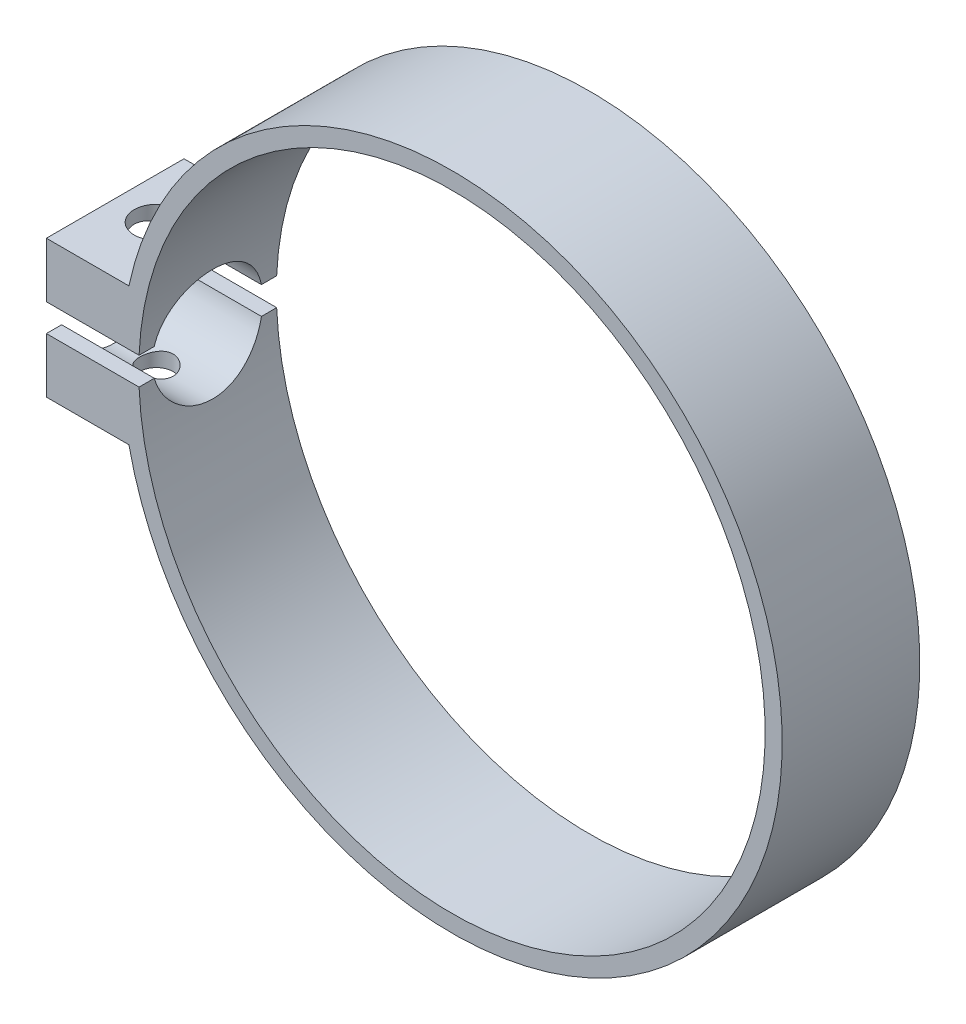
ISO-10303-21;
HEADER;
FILE_DESCRIPTION(('STEP AP214'),'2;1');
FILE_NAME('part.step','',(''),(''),'','','');
FILE_SCHEMA(('AUTOMOTIVE_DESIGN { 1 0 10303 214 1 1 1 1 }'));
ENDSEC;
DATA;
#1=APPLICATION_CONTEXT('core data for automotive mechanical design processes');
#2=APPLICATION_PROTOCOL_DEFINITION('international standard','automotive_design',2000,#1);
#3=PRODUCT_CONTEXT('',#1,'mechanical');
#4=PRODUCT('Part','Part','',(#3));
#5=PRODUCT_RELATED_PRODUCT_CATEGORY('part','',(#4));
#6=PRODUCT_DEFINITION_FORMATION('','',#4);
#7=PRODUCT_DEFINITION_CONTEXT('part definition',#1,'design');
#8=PRODUCT_DEFINITION('design','',#6,#7);
#9=PRODUCT_DEFINITION_SHAPE('','',#8);
#10=(LENGTH_UNIT() NAMED_UNIT(*) SI_UNIT(.MILLI.,.METRE.));
#11=(NAMED_UNIT(*) PLANE_ANGLE_UNIT() SI_UNIT($,.RADIAN.));
#12=(NAMED_UNIT(*) SI_UNIT($,.STERADIAN.) SOLID_ANGLE_UNIT());
#13=UNCERTAINTY_MEASURE_WITH_UNIT(LENGTH_MEASURE(1.E-05),#10,'distance_accuracy_value','');
#14=(GEOMETRIC_REPRESENTATION_CONTEXT(3) GLOBAL_UNCERTAINTY_ASSIGNED_CONTEXT((#13)) GLOBAL_UNIT_ASSIGNED_CONTEXT((#10,
#11,#12)) REPRESENTATION_CONTEXT('',''));
#15=CARTESIAN_POINT('',(0.,0.,0.));
#16=DIRECTION('',(0.,0.,1.));
#17=DIRECTION('',(1.,0.,0.));
#18=AXIS2_PLACEMENT_3D('',#15,#16,#17);
#19=CARTESIAN_POINT('',(-46.78900533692,-1.5875,15.875));
#20=DIRECTION('',(0.,-1.,0.));
#21=DIRECTION('',(1.,0.,0.));
#22=AXIS2_PLACEMENT_3D('',#19,#20,#21);
#23=PLANE('',#22);
#24=DIRECTION('',(0.,0.,-1.));
#25=VECTOR('',#24,1.);
#26=CARTESIAN_POINT('',(-36.0966083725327,-1.5875,15.875));
#27=LINE('',#26,#25);
#28=CARTESIAN_POINT('',(-36.0966083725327,-1.5875,15.875));
#29=VERTEX_POINT('',#28);
#30=CARTESIAN_POINT('',(-36.0966083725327,-1.5875,14.1172604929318));
#31=VERTEX_POINT('',#30);
#32=EDGE_CURVE('E145',#29,#31,#27,.T.);
#33=ORIENTED_EDGE('',*,*,#32,.T.);
#34=DIRECTION('',(-1.,0.,0.));
#35=VECTOR('',#34,1.);
#36=CARTESIAN_POINT('',(38.101,-1.58750000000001,14.1172604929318));
#37=LINE('',#36,#35);
#38=CARTESIAN_POINT('',(-46.78900533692,-1.5875,14.1172604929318));
#39=VERTEX_POINT('',#38);
#40=EDGE_CURVE('E129',#39,#31,#37,.F.);
#41=ORIENTED_EDGE('',*,*,#40,.F.);
#42=DIRECTION('',(0.,0.,-1.));
#43=VECTOR('',#42,1.);
#44=CARTESIAN_POINT('',(-46.78900533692,-1.5875,15.875));
#45=LINE('',#44,#43);
#46=CARTESIAN_POINT('',(-46.78900533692,-1.5875,15.875));
#47=VERTEX_POINT('',#46);
#48=EDGE_CURVE('E155',#47,#39,#45,.T.);
#49=ORIENTED_EDGE('',*,*,#48,.F.);
#50=DIRECTION('',(-1.,0.,0.));
#51=VECTOR('',#50,1.);
#52=CARTESIAN_POINT('',(-46.78900533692,-1.5875,15.875));
#53=LINE('',#52,#51);
#54=EDGE_CURVE('E150',#29,#47,#53,.T.);
#55=ORIENTED_EDGE('',*,*,#54,.F.);
#56=EDGE_LOOP('',(#33,#41,#49,#55));
#57=FACE_BOUND('',#56,.T.);
#58=ADVANCED_FACE('F36',(#57),#23,.F.);
#59=CARTESIAN_POINT('',(-46.78900533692,1.5875,15.875));
#60=DIRECTION('',(0.,1.,0.));
#61=DIRECTION('',(-1.,0.,0.));
#62=AXIS2_PLACEMENT_3D('',#59,#60,#61);
#63=PLANE('',#62);
#64=DIRECTION('',(0.,0.,-1.));
#65=VECTOR('',#64,1.);
#66=CARTESIAN_POINT('',(-36.0966083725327,1.5875,15.875));
#67=LINE('',#66,#65);
#68=CARTESIAN_POINT('',(-36.0966083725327,1.5875,1.75773950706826));
#69=VERTEX_POINT('',#68);
#70=CARTESIAN_POINT('',(-36.0966083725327,1.5875,0.));
#71=VERTEX_POINT('',#70);
#72=EDGE_CURVE('E151',#69,#71,#67,.T.);
#73=ORIENTED_EDGE('',*,*,#72,.F.);
#74=DIRECTION('',(-1.,0.,0.));
#75=VECTOR('',#74,1.);
#76=CARTESIAN_POINT('',(38.101,1.58750000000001,1.75773950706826));
#77=LINE('',#76,#75);
#78=CARTESIAN_POINT('',(-46.78900533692,1.5875,1.75773950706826));
#79=VERTEX_POINT('',#78);
#80=EDGE_CURVE('E65',#79,#69,#77,.F.);
#81=ORIENTED_EDGE('',*,*,#80,.F.);
#82=DIRECTION('',(0.,0.,-1.));
#83=VECTOR('',#82,1.);
#84=CARTESIAN_POINT('',(-46.78900533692,1.5875,15.875));
#85=LINE('',#84,#83);
#86=CARTESIAN_POINT('',(-46.78900533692,1.5875,0.));
#87=VERTEX_POINT('',#86);
#88=EDGE_CURVE('E160',#79,#87,#85,.T.);
#89=ORIENTED_EDGE('',*,*,#88,.T.);
#90=DIRECTION('',(1.,0.,0.));
#91=VECTOR('',#90,1.);
#92=CARTESIAN_POINT('',(-46.78900533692,1.5875,0.));
#93=LINE('',#92,#91);
#94=EDGE_CURVE('E183',#87,#71,#93,.T.);
#95=ORIENTED_EDGE('',*,*,#94,.T.);
#96=EDGE_LOOP('',(#73,#81,#89,#95));
#97=FACE_BOUND('',#96,.T.);
#98=ADVANCED_FACE('F275',(#97),#63,.F.);
#99=CARTESIAN_POINT('',(0.,0.,15.875));
#100=DIRECTION('',(0.,0.,-1.));
#101=DIRECTION('',(-1.,0.,0.));
#102=AXIS2_PLACEMENT_3D('',#99,#100,#101);
#103=CYLINDRICAL_SURFACE('',#102,38.1);
#104=CARTESIAN_POINT('',(0.,0.,0.));
#105=DIRECTION('',(0.,0.,1.));
#106=DIRECTION('',(1.,0.,0.));
#107=AXIS2_PLACEMENT_3D('',#104,#105,#106);
#108=CIRCLE('',#107,38.1);
#109=CARTESIAN_POINT('',(-37.26400533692,-7.9375,0.));
#110=VERTEX_POINT('',#109);
#111=CARTESIAN_POINT('',(-37.26400533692,7.9375,0.));
#112=VERTEX_POINT('',#111);
#113=EDGE_CURVE('E187',#110,#112,#108,.T.);
#114=ORIENTED_EDGE('',*,*,#113,.T.);
#115=DIRECTION('',(0.,0.,-1.));
#116=VECTOR('',#115,1.);
#117=CARTESIAN_POINT('',(-37.26400533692,7.9375,15.875));
#118=LINE('',#117,#116);
#119=CARTESIAN_POINT('',(-37.26400533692,7.9375,15.875));
#120=VERTEX_POINT('',#119);
#121=EDGE_CURVE('E11',#120,#112,#118,.T.);
#122=ORIENTED_EDGE('',*,*,#121,.F.);
#123=CARTESIAN_POINT('',(0.,0.,15.875));
#124=DIRECTION('',(0.,0.,1.));
#125=DIRECTION('',(1.,0.,0.));
#126=AXIS2_PLACEMENT_3D('',#123,#124,#125);
#127=CIRCLE('',#126,38.1);
#128=CARTESIAN_POINT('',(-37.26400533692,-7.9375,15.875));
#129=VERTEX_POINT('',#128);
#130=EDGE_CURVE('E199',#129,#120,#127,.T.);
#131=ORIENTED_EDGE('',*,*,#130,.F.);
#132=DIRECTION('',(0.,0.,-1.));
#133=VECTOR('',#132,1.);
#134=CARTESIAN_POINT('',(-37.26400533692,-7.9375,15.875));
#135=LINE('',#134,#133);
#136=EDGE_CURVE('E200',#129,#110,#135,.T.);
#137=ORIENTED_EDGE('',*,*,#136,.T.);
#138=EDGE_LOOP('',(#114,#122,#131,#137));
#139=FACE_BOUND('',#138,.T.);
#140=ADVANCED_FACE('F38',(#139),#103,.T.);
#141=CARTESIAN_POINT('',(-37.26400533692,7.9375,15.875));
#142=DIRECTION('',(0.,-1.,0.));
#143=DIRECTION('',(1.,0.,0.));
#144=AXIS2_PLACEMENT_3D('',#141,#142,#143);
#145=PLANE('',#144);
#146=CARTESIAN_POINT('',(-42.02650533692,7.93750000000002,7.9375));
#147=DIRECTION('',(0.,1.,0.));
#148=DIRECTION('',(-1.,0.,0.));
#149=AXIS2_PLACEMENT_3D('',#146,#147,#148);
#150=CIRCLE('',#149,2.5527);
#151=CARTESIAN_POINT('',(-44.57920533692,7.93750000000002,7.9375));
#152=VERTEX_POINT('',#151);
#153=EDGE_CURVE('E259',#152,#152,#150,.T.);
#154=ORIENTED_EDGE('',*,*,#153,.F.);
#155=EDGE_LOOP('',(#154));
#156=FACE_BOUND('',#155,.T.);
#157=DIRECTION('',(-1.,0.,0.));
#158=VECTOR('',#157,1.);
#159=CARTESIAN_POINT('',(-37.26400533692,7.9375,0.));
#160=LINE('',#159,#158);
#161=CARTESIAN_POINT('',(-46.78900533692,7.9375,0.));
#162=VERTEX_POINT('',#161);
#163=EDGE_CURVE('E180',#112,#162,#160,.T.);
#164=ORIENTED_EDGE('',*,*,#163,.T.);
#165=DIRECTION('',(0.,0.,-1.));
#166=VECTOR('',#165,1.);
#167=CARTESIAN_POINT('',(-46.78900533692,7.9375,15.875));
#168=LINE('',#167,#166);
#169=CARTESIAN_POINT('',(-46.78900533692,7.9375,15.875));
#170=VERTEX_POINT('',#169);
#171=EDGE_CURVE('E50',#170,#162,#168,.T.);
#172=ORIENTED_EDGE('',*,*,#171,.F.);
#173=DIRECTION('',(-1.,0.,0.));
#174=VECTOR('',#173,1.);
#175=CARTESIAN_POINT('',(-37.26400533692,7.9375,15.875));
#176=LINE('',#175,#174);
#177=EDGE_CURVE('E298',#120,#170,#176,.T.);
#178=ORIENTED_EDGE('',*,*,#177,.F.);
#179=ORIENTED_EDGE('',*,*,#121,.T.);
#180=EDGE_LOOP('',(#164,#172,#178,#179));
#181=FACE_BOUND('',#180,.T.);
#182=ADVANCED_FACE('F335',(#156,#181),#145,.F.);
#183=CARTESIAN_POINT('',(-46.78900533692,7.9375,15.875));
#184=DIRECTION('',(1.,0.,0.));
#185=DIRECTION('',(0.,0.,-1.));
#186=AXIS2_PLACEMENT_3D('',#183,#184,#185);
#187=PLANE('',#186);
#188=ORIENTED_EDGE('',*,*,#88,.F.);
#189=CARTESIAN_POINT('',(-46.78900533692,0.127000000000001,7.93750000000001));
#190=DIRECTION('',(-1.,0.,0.));
#191=DIRECTION('',(0.,0.,1.));
#192=AXIS2_PLACEMENT_3D('',#189,#190,#191);
#193=CIRCLE('',#192,6.35);
#194=CARTESIAN_POINT('',(-46.78900533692,1.5875,14.1172604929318));
#195=VERTEX_POINT('',#194);
#196=EDGE_CURVE('E222',#195,#79,#193,.T.);
#197=ORIENTED_EDGE('',*,*,#196,.F.);
#198=CARTESIAN_POINT('',(-46.78900533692,1.5875,15.875));
#199=VERTEX_POINT('',#198);
#200=EDGE_CURVE('E161',#199,#195,#85,.T.);
#201=ORIENTED_EDGE('',*,*,#200,.F.);
#202=DIRECTION('',(0.,-1.,0.));
#203=VECTOR('',#202,1.);
#204=CARTESIAN_POINT('',(-46.78900533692,7.9375,15.875));
#205=LINE('',#204,#203);
#206=EDGE_CURVE('E175',#170,#199,#205,.T.);
#207=ORIENTED_EDGE('',*,*,#206,.F.);
#208=ORIENTED_EDGE('',*,*,#171,.T.);
#209=DIRECTION('',(0.,-1.,0.));
#210=VECTOR('',#209,1.);
#211=CARTESIAN_POINT('',(-46.78900533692,7.9375,0.));
#212=LINE('',#211,#210);
#213=EDGE_CURVE('E172',#162,#87,#212,.T.);
#214=ORIENTED_EDGE('',*,*,#213,.T.);
#215=EDGE_LOOP('',(#188,#197,#201,#207,#208,#214));
#216=FACE_BOUND('',#215,.T.);
#217=ADVANCED_FACE('F171',(#216),#187,.F.);
#218=ORIENTED_EDGE('',*,*,#200,.T.);
#219=DIRECTION('',(-1.,0.,0.));
#220=VECTOR('',#219,1.);
#221=CARTESIAN_POINT('',(38.101,1.58750000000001,14.1172604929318));
#222=LINE('',#221,#220);
#223=CARTESIAN_POINT('',(-36.0966083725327,1.5875,14.1172604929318));
#224=VERTEX_POINT('',#223);
#225=EDGE_CURVE('E228',#224,#195,#222,.T.);
#226=ORIENTED_EDGE('',*,*,#225,.F.);
#227=CARTESIAN_POINT('',(-36.0966083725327,1.5875,15.875));
#228=VERTEX_POINT('',#227);
#229=EDGE_CURVE('E153',#228,#224,#67,.T.);
#230=ORIENTED_EDGE('',*,*,#229,.F.);
#231=DIRECTION('',(1.,0.,0.));
#232=VECTOR('',#231,1.);
#233=CARTESIAN_POINT('',(-46.78900533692,1.5875,15.875));
#234=LINE('',#233,#232);
#235=EDGE_CURVE('E303',#199,#228,#234,.T.);
#236=ORIENTED_EDGE('',*,*,#235,.F.);
#237=EDGE_LOOP('',(#218,#226,#230,#236));
#238=FACE_BOUND('',#237,.T.);
#239=ADVANCED_FACE('F283',(#238),#63,.F.);
#240=CARTESIAN_POINT('',(0.,0.,15.875));
#241=DIRECTION('',(0.,0.,-1.));
#242=DIRECTION('',(-1.,0.,0.));
#243=AXIS2_PLACEMENT_3D('',#240,#241,#242);
#244=CYLINDRICAL_SURFACE('',#243,36.1315);
#245=CARTESIAN_POINT('',(-36.0966083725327,-1.58750000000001,1.75773950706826));
#246=VERTEX_POINT('',#245);
#247=CARTESIAN_POINT('',(-36.0966083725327,-1.5875,0.));
#248=VERTEX_POINT('',#247);
#249=EDGE_CURVE('E148',#246,#248,#27,.T.);
#250=ORIENTED_EDGE('',*,*,#249,.F.);
#251=CARTESIAN_POINT('',(-36.0966083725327,-1.5875,14.1172604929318));
#252=CARTESIAN_POINT('',(-36.0889745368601,-1.76132982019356,14.0761983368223));
#253=CARTESIAN_POINT('',(-36.0801399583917,-1.93335947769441,14.0277786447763));
#254=CARTESIAN_POINT('',(-36.060355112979,-2.27260532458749,13.9166858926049));
#255=CARTESIAN_POINT('',(-36.0494051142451,-2.43982212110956,13.8540146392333));
#256=CARTESIAN_POINT('',(-36.0256858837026,-2.76809747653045,13.7149445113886));
#257=CARTESIAN_POINT('',(-36.0129186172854,-2.92916245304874,13.6385604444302));
#258=CARTESIAN_POINT('',(-35.9859053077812,-3.24420959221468,13.4725881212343));
#259=CARTESIAN_POINT('',(-35.9716592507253,-3.39819168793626,13.3829997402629));
#260=CARTESIAN_POINT('',(-35.9420752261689,-3.69800183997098,13.1912706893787));
#261=CARTESIAN_POINT('',(-35.9267373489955,-3.84383056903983,13.0891310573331));
#262=CARTESIAN_POINT('',(-35.895379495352,-4.1264078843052,12.872972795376));
#263=CARTESIAN_POINT('',(-35.8793592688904,-4.26315309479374,12.7589497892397));
#264=CARTESIAN_POINT('',(-35.8470845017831,-4.52652454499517,12.5198902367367));
#265=CARTESIAN_POINT('',(-35.8308300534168,-4.65315464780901,12.3948579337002));
#266=CARTESIAN_POINT('',(-35.7985193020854,-4.89553531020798,12.1345477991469));
#267=CARTESIAN_POINT('',(-35.7824630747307,-5.01128182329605,11.99926619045));
#268=CARTESIAN_POINT('',(-35.7508879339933,-5.23180673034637,11.71844452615));
#269=CARTESIAN_POINT('',(-35.73537352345,-5.33650342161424,11.5728397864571));
#270=CARTESIAN_POINT('',(-35.7054321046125,-5.533292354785,11.2731630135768));
#271=CARTESIAN_POINT('',(-35.6910055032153,-5.62537989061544,11.1190878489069));
#272=CARTESIAN_POINT('',(-35.6636614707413,-5.79620800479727,10.8036373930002));
#273=CARTESIAN_POINT('',(-35.6507435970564,-5.87495250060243,10.6422642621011));
#274=CARTESIAN_POINT('',(-35.6267802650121,-6.01856510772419,10.313250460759));
#275=CARTESIAN_POINT('',(-35.6157354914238,-6.08342814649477,10.1456075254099));
#276=CARTESIAN_POINT('',(-35.5959127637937,-6.19836007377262,9.80643943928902));
#277=CARTESIAN_POINT('',(-35.5871202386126,-6.24852437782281,9.63494747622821));
#278=CARTESIAN_POINT('',(-35.5719600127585,-6.33426016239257,9.28817846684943));
#279=CARTESIAN_POINT('',(-35.5655932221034,-6.36982616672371,9.11290002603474));
#280=CARTESIAN_POINT('',(-35.5554793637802,-6.4260404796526,8.75999412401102));
#281=CARTESIAN_POINT('',(-35.5517308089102,-6.44669725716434,8.5823680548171));
#282=CARTESIAN_POINT('',(-35.5469573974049,-6.47296621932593,8.22588898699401));
#283=CARTESIAN_POINT('',(-35.5459337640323,-6.47857164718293,8.04703547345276));
#284=CARTESIAN_POINT('',(-35.5466389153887,-6.47470125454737,7.69204467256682));
#285=CARTESIAN_POINT('',(-35.5483287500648,-6.46543885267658,7.51590494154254));
#286=CARTESIAN_POINT('',(-35.5543377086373,-6.43231255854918,7.16513096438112));
#287=CARTESIAN_POINT('',(-35.5586556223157,-6.4084553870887,6.99049606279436));
#288=CARTESIAN_POINT('',(-35.5697984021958,-6.3463161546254,6.64380965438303));
#289=CARTESIAN_POINT('',(-35.5766244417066,-6.30802734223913,6.47175939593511));
#290=CARTESIAN_POINT('',(-35.5925855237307,-6.21733580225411,6.13159780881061));
#291=CARTESIAN_POINT('',(-35.6017197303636,-6.16493818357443,5.96348507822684));
#292=CARTESIAN_POINT('',(-35.6220430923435,-6.04639992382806,5.63225501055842));
#293=CARTESIAN_POINT('',(-35.6332328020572,-5.98025557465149,5.46913903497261));
#294=CARTESIAN_POINT('',(-35.6573484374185,-5.83474317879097,5.14912168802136));
#295=CARTESIAN_POINT('',(-35.6702737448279,-5.75537983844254,4.99221812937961));
#296=CARTESIAN_POINT('',(-35.6975113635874,-5.58395072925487,4.68556909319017));
#297=CARTESIAN_POINT('',(-35.7118241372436,-5.49188072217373,4.53582602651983));
#298=CARTESIAN_POINT('',(-35.7414369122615,-5.29573506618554,4.24460292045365));
#299=CARTESIAN_POINT('',(-35.7567365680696,-5.19166360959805,4.10312002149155));
#300=CARTESIAN_POINT('',(-35.7881417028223,-4.97059818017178,3.82729976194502));
#301=CARTESIAN_POINT('',(-35.8042556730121,-4.85343806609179,3.69309649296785));
#302=CARTESIAN_POINT('',(-35.8366292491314,-4.60831529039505,3.43505961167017));
#303=CARTESIAN_POINT('',(-35.852888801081,-4.48035649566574,3.31122231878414));
#304=CARTESIAN_POINT('',(-35.8851209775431,-4.21441906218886,3.07466244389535));
#305=CARTESIAN_POINT('',(-35.9010934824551,-4.07643636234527,2.96194441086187));
#306=CARTESIAN_POINT('',(-35.9323034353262,-3.79148942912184,2.74850276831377));
#307=CARTESIAN_POINT('',(-35.9475411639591,-3.64452867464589,2.64777455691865));
#308=CARTESIAN_POINT('',(-35.9764251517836,-3.34719931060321,2.46186194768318));
#309=CARTESIAN_POINT('',(-35.9901058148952,-3.19707208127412,2.37629661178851));
#310=CARTESIAN_POINT('',(-36.0160444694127,-2.89025000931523,2.21764167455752));
#311=CARTESIAN_POINT('',(-36.0283025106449,-2.73355539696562,2.14455163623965));
#312=CARTESIAN_POINT('',(-36.0510891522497,-2.41449922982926,2.01130892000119));
#313=CARTESIAN_POINT('',(-36.0616164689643,-2.25213357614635,1.95116583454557));
#314=CARTESIAN_POINT('',(-36.0806747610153,-1.92290955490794,1.84428861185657));
#315=CARTESIAN_POINT('',(-36.0892054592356,-1.75605056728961,1.79755633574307));
#316=CARTESIAN_POINT('',(-36.0966083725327,-1.5875,1.75773950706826));
#317=B_SPLINE_CURVE_WITH_KNOTS('',3,(#251,#252,#253,#254,#255,#256,#257,#258,#259,#260,#261,
#262,#263,#264,#265,#266,#267,#268,#269,#270,#271,#272,#273,#274,#275,#276,#277,#278,#279,#280,
#281,#282,#283,#284,#285,#286,#287,#288,#289,#290,#291,#292,#293,#294,#295,#296,#297,#298,#299,
#300,#301,#302,#303,#304,#305,#306,#307,#308,#309,#310,#311,#312,#313,#314,#315,#316),
.UNSPECIFIED.,.F.,.F.,(4,2,2,2,2,2,2,2,2,2,2,2,2,2,2,2,2,2,2,2,2,2,2,2,2,2,2,2,2,2,2,2,4),(0.,
0.536155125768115,1.07224231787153,1.6077540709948,2.14327088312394,2.6787434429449,
3.21441389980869,3.74987878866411,4.28554198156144,4.82492306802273,5.36450492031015,
5.90392807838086,6.44354801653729,6.97958324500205,7.51581937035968,8.05175065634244,
8.58792249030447,9.11646648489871,9.64476727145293,10.1733155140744,10.7016726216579,
11.2301724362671,11.7584844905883,12.2869731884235,12.8152778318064,13.3512773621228,
13.88708576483,14.4231124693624,14.958932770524,15.4783789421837,15.9978069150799,
16.5176184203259,17.0375020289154),.UNSPECIFIED.);
#318=EDGE_CURVE('E132',#31,#246,#317,.T.);
#319=ORIENTED_EDGE('',*,*,#318,.F.);
#320=ORIENTED_EDGE('',*,*,#32,.F.);
#321=CARTESIAN_POINT('',(0.,0.,15.875));
#322=DIRECTION('',(0.,0.,-1.));
#323=DIRECTION('',(1.,0.,0.));
#324=AXIS2_PLACEMENT_3D('',#321,#322,#323);
#325=CIRCLE('',#324,36.1315);
#326=EDGE_CURVE('E218',#228,#29,#325,.T.);
#327=ORIENTED_EDGE('',*,*,#326,.F.);
#328=ORIENTED_EDGE('',*,*,#229,.T.);
#329=CARTESIAN_POINT('',(-36.0966083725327,1.5875,1.75773950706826));
#330=CARTESIAN_POINT('',(-36.0889745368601,1.76132982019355,1.79880166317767));
#331=CARTESIAN_POINT('',(-36.0801399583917,1.9333594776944,1.84722135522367));
#332=CARTESIAN_POINT('',(-36.060355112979,2.27260532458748,1.95831410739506));
#333=CARTESIAN_POINT('',(-36.0494051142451,2.43982212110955,2.02098536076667));
#334=CARTESIAN_POINT('',(-36.0256858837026,2.76809747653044,2.16005548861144));
#335=CARTESIAN_POINT('',(-36.0129186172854,2.92916245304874,2.2364395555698));
#336=CARTESIAN_POINT('',(-35.9859053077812,3.24420959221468,2.40241187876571));
#337=CARTESIAN_POINT('',(-35.9716592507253,3.39819168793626,2.49200025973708));
#338=CARTESIAN_POINT('',(-35.9420752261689,3.69800183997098,2.6837293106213));
#339=CARTESIAN_POINT('',(-35.9267373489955,3.84383056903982,2.7858689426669));
#340=CARTESIAN_POINT('',(-35.895379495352,4.1264078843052,3.002027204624));
#341=CARTESIAN_POINT('',(-35.8793592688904,4.26315309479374,3.11605021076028));
#342=CARTESIAN_POINT('',(-35.8470845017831,4.52652454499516,3.3551097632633));
#343=CARTESIAN_POINT('',(-35.8308300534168,4.653154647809,3.48014206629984));
#344=CARTESIAN_POINT('',(-35.7985193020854,4.89553531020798,3.7404522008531));
#345=CARTESIAN_POINT('',(-35.7824630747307,5.01128182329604,3.87573380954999));
#346=CARTESIAN_POINT('',(-35.7508879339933,5.23180673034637,4.15655547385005));
#347=CARTESIAN_POINT('',(-35.73537352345,5.33650342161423,4.30216021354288));
#348=CARTESIAN_POINT('',(-35.7054321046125,5.533292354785,4.60183698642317));
#349=CARTESIAN_POINT('',(-35.6910055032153,5.62537989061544,4.75591215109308));
#350=CARTESIAN_POINT('',(-35.6636614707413,5.79620800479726,5.07136260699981));
#351=CARTESIAN_POINT('',(-35.6507435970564,5.87495250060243,5.23273573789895));
#352=CARTESIAN_POINT('',(-35.6267802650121,6.01856510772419,5.56174953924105));
#353=CARTESIAN_POINT('',(-35.6157354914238,6.08342814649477,5.72939247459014));
#354=CARTESIAN_POINT('',(-35.5959127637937,6.19836007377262,6.06856056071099));
#355=CARTESIAN_POINT('',(-35.5871202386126,6.24852437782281,6.2400525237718));
#356=CARTESIAN_POINT('',(-35.5719600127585,6.33426016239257,6.58682153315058));
#357=CARTESIAN_POINT('',(-35.5655932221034,6.36982616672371,6.76209997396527));
#358=CARTESIAN_POINT('',(-35.5554793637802,6.4260404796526,7.11500587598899));
#359=CARTESIAN_POINT('',(-35.5517308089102,6.44669725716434,7.29263194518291));
#360=CARTESIAN_POINT('',(-35.5469573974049,6.47296621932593,7.649111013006));
#361=CARTESIAN_POINT('',(-35.5459337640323,6.47857164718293,7.82796452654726));
#362=CARTESIAN_POINT('',(-35.5466389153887,6.47470125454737,8.18295532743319));
#363=CARTESIAN_POINT('',(-35.5483287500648,6.46543885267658,8.35909505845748));
#364=CARTESIAN_POINT('',(-35.5543377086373,6.43231255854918,8.70986903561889));
#365=CARTESIAN_POINT('',(-35.5586556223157,6.4084553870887,8.88450393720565));
#366=CARTESIAN_POINT('',(-35.5697984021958,6.3463161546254,9.23119034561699));
#367=CARTESIAN_POINT('',(-35.5766244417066,6.30802734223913,9.40324060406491));
#368=CARTESIAN_POINT('',(-35.5925855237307,6.21733580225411,9.7434021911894));
#369=CARTESIAN_POINT('',(-35.6017197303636,6.16493818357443,9.91151492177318));
#370=CARTESIAN_POINT('',(-35.6220430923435,6.04639992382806,10.2427449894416));
#371=CARTESIAN_POINT('',(-35.6332328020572,5.9802555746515,10.4058609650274));
#372=CARTESIAN_POINT('',(-35.6573484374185,5.83474317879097,10.7258783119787));
#373=CARTESIAN_POINT('',(-35.6702737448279,5.75537983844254,10.8827818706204));
#374=CARTESIAN_POINT('',(-35.6975113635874,5.58395072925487,11.1894309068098));
#375=CARTESIAN_POINT('',(-35.7118241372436,5.49188072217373,11.3391739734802));
#376=CARTESIAN_POINT('',(-35.7414369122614,5.29573506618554,11.6303970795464));
#377=CARTESIAN_POINT('',(-35.7567365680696,5.19166360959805,11.7718799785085));
#378=CARTESIAN_POINT('',(-35.7881417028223,4.97059818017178,12.047700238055));
#379=CARTESIAN_POINT('',(-35.8042556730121,4.85343806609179,12.1819035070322));
#380=CARTESIAN_POINT('',(-35.8366292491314,4.60831529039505,12.4399403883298));
#381=CARTESIAN_POINT('',(-35.852888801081,4.48035649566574,12.5637776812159));
#382=CARTESIAN_POINT('',(-35.8851209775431,4.21441906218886,12.8003375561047));
#383=CARTESIAN_POINT('',(-35.9010934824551,4.07643636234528,12.9130555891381));
#384=CARTESIAN_POINT('',(-35.9323034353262,3.79148942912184,13.1264972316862));
#385=CARTESIAN_POINT('',(-35.9475411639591,3.64452867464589,13.2272254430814));
#386=CARTESIAN_POINT('',(-35.9764251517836,3.34719931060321,13.4131380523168));
#387=CARTESIAN_POINT('',(-35.9901058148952,3.19707208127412,13.4987033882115));
#388=CARTESIAN_POINT('',(-36.0160444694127,2.89025000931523,13.6573583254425));
#389=CARTESIAN_POINT('',(-36.0283025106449,2.73355539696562,13.7304483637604));
#390=CARTESIAN_POINT('',(-36.0510891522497,2.41449922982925,13.8636910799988));
#391=CARTESIAN_POINT('',(-36.0616164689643,2.25213357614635,13.9238341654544));
#392=CARTESIAN_POINT('',(-36.0806747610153,1.92290955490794,14.0307113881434));
#393=CARTESIAN_POINT('',(-36.0892054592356,1.75605056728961,14.0774436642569));
#394=CARTESIAN_POINT('',(-36.0966083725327,1.5875,14.1172604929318));
#395=B_SPLINE_CURVE_WITH_KNOTS('',3,(#329,#330,#331,#332,#333,#334,#335,#336,#337,#338,#339,
#340,#341,#342,#343,#344,#345,#346,#347,#348,#349,#350,#351,#352,#353,#354,#355,#356,#357,#358,
#359,#360,#361,#362,#363,#364,#365,#366,#367,#368,#369,#370,#371,#372,#373,#374,#375,#376,#377,
#378,#379,#380,#381,#382,#383,#384,#385,#386,#387,#388,#389,#390,#391,#392,#393,#394),
.UNSPECIFIED.,.F.,.F.,(4,2,2,2,2,2,2,2,2,2,2,2,2,2,2,2,2,2,2,2,2,2,2,2,2,2,2,2,2,2,2,2,4),(0.,
0.536155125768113,1.07224231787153,1.60775407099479,2.14327088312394,2.6787434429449,
3.21441389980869,3.74987878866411,4.28554198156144,4.82492306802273,5.36450492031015,
5.90392807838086,6.44354801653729,6.97958324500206,7.51581937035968,8.05175065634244,
8.58792249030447,9.11646648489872,9.64476727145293,10.1733155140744,10.7016726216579,
11.2301724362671,11.7584844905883,12.2869731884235,12.8152778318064,13.3512773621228,
13.88708576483,14.4231124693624,14.9589327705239,15.4783789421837,15.9978069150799,
16.5176184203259,17.0375020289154),.UNSPECIFIED.);
#396=EDGE_CURVE('E225',#69,#224,#395,.T.);
#397=ORIENTED_EDGE('',*,*,#396,.F.);
#398=ORIENTED_EDGE('',*,*,#72,.T.);
#399=CARTESIAN_POINT('',(0.,0.,0.));
#400=DIRECTION('',(0.,0.,-1.));
#401=DIRECTION('',(1.,0.,0.));
#402=AXIS2_PLACEMENT_3D('',#399,#400,#401);
#403=CIRCLE('',#402,36.1315);
#404=EDGE_CURVE('E185',#71,#248,#403,.T.);
#405=ORIENTED_EDGE('',*,*,#404,.T.);
#406=EDGE_LOOP('',(#250,#319,#320,#327,#328,#397,#398,#405));
#407=FACE_BOUND('',#406,.T.);
#408=ADVANCED_FACE('F143',(#407),#244,.F.);
#409=CARTESIAN_POINT('',(-46.78900533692,-1.5875,1.75773950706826));
#410=VERTEX_POINT('',#409);
#411=CARTESIAN_POINT('',(-46.78900533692,-1.5875,0.));
#412=VERTEX_POINT('',#411);
#413=EDGE_CURVE('E205',#410,#412,#45,.T.);
#414=ORIENTED_EDGE('',*,*,#413,.F.);
#415=DIRECTION('',(-1.,0.,0.));
#416=VECTOR('',#415,1.);
#417=CARTESIAN_POINT('',(38.101,-1.58750000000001,1.75773950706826));
#418=LINE('',#417,#416);
#419=EDGE_CURVE('E57',#246,#410,#418,.T.);
#420=ORIENTED_EDGE('',*,*,#419,.F.);
#421=ORIENTED_EDGE('',*,*,#249,.T.);
#422=DIRECTION('',(-1.,0.,0.));
#423=VECTOR('',#422,1.);
#424=CARTESIAN_POINT('',(-46.78900533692,-1.5875,0.));
#425=LINE('',#424,#423);
#426=EDGE_CURVE('E192',#248,#412,#425,.T.);
#427=ORIENTED_EDGE('',*,*,#426,.T.);
#428=EDGE_LOOP('',(#414,#420,#421,#427));
#429=FACE_BOUND('',#428,.T.);
#430=ADVANCED_FACE('F277',(#429),#23,.F.);
#431=CARTESIAN_POINT('',(-46.78900533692,-7.9375,15.875));
#432=DIRECTION('',(1.,0.,0.));
#433=DIRECTION('',(0.,0.,-1.));
#434=AXIS2_PLACEMENT_3D('',#431,#432,#433);
#435=PLANE('',#434);
#436=ORIENTED_EDGE('',*,*,#48,.T.);
#437=CARTESIAN_POINT('',(-46.78900533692,-0.127000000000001,7.93750000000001));
#438=DIRECTION('',(-1.,0.,0.));
#439=DIRECTION('',(0.,0.,1.));
#440=AXIS2_PLACEMENT_3D('',#437,#438,#439);
#441=CIRCLE('',#440,6.35);
#442=EDGE_CURVE('E133',#410,#39,#441,.T.);
#443=ORIENTED_EDGE('',*,*,#442,.F.);
#444=ORIENTED_EDGE('',*,*,#413,.T.);
#445=DIRECTION('',(0.,-1.,0.));
#446=VECTOR('',#445,1.);
#447=CARTESIAN_POINT('',(-46.78900533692,-7.9375,0.));
#448=LINE('',#447,#446);
#449=CARTESIAN_POINT('',(-46.78900533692,-7.9375,0.));
#450=VERTEX_POINT('',#449);
#451=EDGE_CURVE('E195',#412,#450,#448,.T.);
#452=ORIENTED_EDGE('',*,*,#451,.T.);
#453=DIRECTION('',(0.,0.,-1.));
#454=VECTOR('',#453,1.);
#455=CARTESIAN_POINT('',(-46.78900533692,-7.9375,15.875));
#456=LINE('',#455,#454);
#457=CARTESIAN_POINT('',(-46.78900533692,-7.9375,15.875));
#458=VERTEX_POINT('',#457);
#459=EDGE_CURVE('E202',#458,#450,#456,.T.);
#460=ORIENTED_EDGE('',*,*,#459,.F.);
#461=DIRECTION('',(0.,-1.,0.));
#462=VECTOR('',#461,1.);
#463=CARTESIAN_POINT('',(-46.78900533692,-7.9375,15.875));
#464=LINE('',#463,#462);
#465=EDGE_CURVE('E214',#47,#458,#464,.T.);
#466=ORIENTED_EDGE('',*,*,#465,.F.);
#467=EDGE_LOOP('',(#436,#443,#444,#452,#460,#466));
#468=FACE_BOUND('',#467,.T.);
#469=ADVANCED_FACE('F213',(#468),#435,.F.);
#470=CARTESIAN_POINT('',(-37.26400533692,-7.9375,15.875));
#471=DIRECTION('',(0.,1.,0.));
#472=DIRECTION('',(-1.,0.,0.));
#473=AXIS2_PLACEMENT_3D('',#470,#471,#472);
#474=PLANE('',#473);
#475=CARTESIAN_POINT('',(-42.02650533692,-7.9375,7.9375));
#476=DIRECTION('',(0.,1.,0.));
#477=DIRECTION('',(-1.,0.,0.));
#478=AXIS2_PLACEMENT_3D('',#475,#476,#477);
#479=CIRCLE('',#478,1.92659);
#480=CARTESIAN_POINT('',(-43.95309533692,-7.9375,7.9375));
#481=VERTEX_POINT('',#480);
#482=EDGE_CURVE('E330',#481,#481,#479,.T.);
#483=ORIENTED_EDGE('',*,*,#482,.T.);
#484=EDGE_LOOP('',(#483));
#485=FACE_BOUND('',#484,.T.);
#486=DIRECTION('',(1.,0.,0.));
#487=VECTOR('',#486,1.);
#488=CARTESIAN_POINT('',(-37.26400533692,-7.9375,0.));
#489=LINE('',#488,#487);
#490=EDGE_CURVE('E197',#450,#110,#489,.T.);
#491=ORIENTED_EDGE('',*,*,#490,.T.);
#492=ORIENTED_EDGE('',*,*,#136,.F.);
#493=DIRECTION('',(1.,0.,0.));
#494=VECTOR('',#493,1.);
#495=CARTESIAN_POINT('',(-37.26400533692,-7.9375,15.875));
#496=LINE('',#495,#494);
#497=EDGE_CURVE('E203',#458,#129,#496,.T.);
#498=ORIENTED_EDGE('',*,*,#497,.F.);
#499=ORIENTED_EDGE('',*,*,#459,.T.);
#500=EDGE_LOOP('',(#491,#492,#498,#499));
#501=FACE_BOUND('',#500,.T.);
#502=ADVANCED_FACE('F292',(#485,#501),#474,.F.);
#503=CARTESIAN_POINT('',(0.,0.,15.875));
#504=DIRECTION('',(0.,0.,1.));
#505=DIRECTION('',(1.,0.,0.));
#506=AXIS2_PLACEMENT_3D('',#503,#504,#505);
#507=PLANE('',#506);
#508=ORIENTED_EDGE('',*,*,#130,.T.);
#509=ORIENTED_EDGE('',*,*,#177,.T.);
#510=ORIENTED_EDGE('',*,*,#206,.T.);
#511=ORIENTED_EDGE('',*,*,#235,.T.);
#512=ORIENTED_EDGE('',*,*,#326,.T.);
#513=ORIENTED_EDGE('',*,*,#54,.T.);
#514=ORIENTED_EDGE('',*,*,#465,.T.);
#515=ORIENTED_EDGE('',*,*,#497,.T.);
#516=EDGE_LOOP('',(#508,#509,#510,#511,#512,#513,#514,#515));
#517=FACE_BOUND('',#516,.T.);
#518=ADVANCED_FACE('F304',(#517),#507,.T.);
#519=CARTESIAN_POINT('',(0.,0.,0.));
#520=DIRECTION('',(0.,0.,1.));
#521=DIRECTION('',(1.,0.,0.));
#522=AXIS2_PLACEMENT_3D('',#519,#520,#521);
#523=PLANE('',#522);
#524=ORIENTED_EDGE('',*,*,#113,.F.);
#525=ORIENTED_EDGE('',*,*,#490,.F.);
#526=ORIENTED_EDGE('',*,*,#451,.F.);
#527=ORIENTED_EDGE('',*,*,#426,.F.);
#528=ORIENTED_EDGE('',*,*,#404,.F.);
#529=ORIENTED_EDGE('',*,*,#94,.F.);
#530=ORIENTED_EDGE('',*,*,#213,.F.);
#531=ORIENTED_EDGE('',*,*,#163,.F.);
#532=EDGE_LOOP('',(#524,#525,#526,#527,#528,#529,#530,#531));
#533=FACE_BOUND('',#532,.T.);
#534=ADVANCED_FACE('F179',(#533),#523,.F.);
#535=CARTESIAN_POINT('',(38.101,0.127000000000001,7.93750000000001));
#536=DIRECTION('',(-1.,0.,0.));
#537=DIRECTION('',(0.,0.,1.));
#538=AXIS2_PLACEMENT_3D('',#535,#536,#537);
#539=CYLINDRICAL_SURFACE('',#538,6.35);
#540=CARTESIAN_POINT('',(-44.57920533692,6.477,7.9375));
#541=CARTESIAN_POINT('',(-44.5791959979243,6.47699304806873,7.80034740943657));
#542=CARTESIAN_POINT('',(-44.5680882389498,6.47250570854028,7.66297382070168));
#543=CARTESIAN_POINT('',(-44.524051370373,6.45499859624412,7.39209378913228));
#544=CARTESIAN_POINT('',(-44.4910632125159,6.44195573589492,7.2585988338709));
#545=CARTESIAN_POINT('',(-44.4046578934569,6.4087396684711,6.99984152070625));
#546=CARTESIAN_POINT('',(-44.3513078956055,6.38858991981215,6.87455366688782));
#547=CARTESIAN_POINT('',(-44.2259622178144,6.34314281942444,6.63482048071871));
#548=CARTESIAN_POINT('',(-44.1539729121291,6.31784722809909,6.52037145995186));
#549=CARTESIAN_POINT('',(-43.9897798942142,6.26331999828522,6.29996460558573));
#550=CARTESIAN_POINT('',(-43.8968360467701,6.2339653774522,6.19458878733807));
#551=CARTESIAN_POINT('',(-43.6949348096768,6.1751863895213,6.00042676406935));
#552=CARTESIAN_POINT('',(-43.5859695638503,6.14576199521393,5.91164874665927));
#553=CARTESIAN_POINT('',(-43.3491581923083,6.08869986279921,5.74926186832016));
#554=CARTESIAN_POINT('',(-43.2206826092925,6.06120233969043,5.67651660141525));
#555=CARTESIAN_POINT('',(-42.9520488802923,6.01303907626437,5.5539282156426));
#556=CARTESIAN_POINT('',(-42.8118963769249,5.99237005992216,5.50407411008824));
#557=CARTESIAN_POINT('',(-42.5305763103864,5.96152558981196,5.4310429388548));
#558=CARTESIAN_POINT('',(-42.3897477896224,5.95091378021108,5.4067509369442));
#559=CARTESIAN_POINT('',(-42.1056443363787,5.94012158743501,5.3820512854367));
#560=CARTESIAN_POINT('',(-41.962370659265,5.93993600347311,5.38163172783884));
#561=CARTESIAN_POINT('',(-41.6882036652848,5.94964534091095,5.40384454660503));
#562=CARTESIAN_POINT('',(-41.5571489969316,5.95883133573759,5.42485573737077));
#563=CARTESIAN_POINT('',(-41.3006122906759,5.98505796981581,5.48662856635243));
#564=CARTESIAN_POINT('',(-41.1751312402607,6.00209999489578,5.52739368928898));
#565=CARTESIAN_POINT('',(-40.9302591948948,6.04249406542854,5.62829575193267));
#566=CARTESIAN_POINT('',(-40.8110459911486,6.06596841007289,5.6888130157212));
#567=CARTESIAN_POINT('',(-40.5840255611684,6.11654915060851,5.8272342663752));
#568=CARTESIAN_POINT('',(-40.4762226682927,6.14365691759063,5.90514482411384));
#569=CARTESIAN_POINT('',(-40.2662175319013,6.20102992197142,6.08329646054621));
#570=CARTESIAN_POINT('',(-40.1651113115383,6.23137636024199,6.18480680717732));
#571=CARTESIAN_POINT('',(-39.9810044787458,6.29000797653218,6.40366287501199));
#572=CARTESIAN_POINT('',(-39.8980075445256,6.31829273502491,6.52101180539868));
#573=CARTESIAN_POINT('',(-39.7510172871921,6.37033551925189,6.77134890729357));
#574=CARTESIAN_POINT('',(-39.6874402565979,6.39399093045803,6.90460440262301));
#575=CARTESIAN_POINT('',(-39.5839836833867,6.43333251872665,7.18111152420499));
#576=CARTESIAN_POINT('',(-39.5440919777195,6.44902278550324,7.32435797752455));
#577=CARTESIAN_POINT('',(-39.4913641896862,6.46991864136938,7.60759704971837));
#578=CARTESIAN_POINT('',(-39.4770554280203,6.47569410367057,7.74727360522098));
#579=CARTESIAN_POINT('',(-39.471546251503,6.47790754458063,8.02713819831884));
#580=CARTESIAN_POINT('',(-39.4803397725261,6.47434797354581,8.16732609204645));
#581=CARTESIAN_POINT('',(-39.5197060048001,6.45866393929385,8.43753267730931));
#582=CARTESIAN_POINT('',(-39.5492700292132,6.44693636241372,8.5677238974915));
#583=CARTESIAN_POINT('',(-39.6279618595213,6.41650889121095,8.82117517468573));
#584=CARTESIAN_POINT('',(-39.6770921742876,6.39780810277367,8.94443434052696));
#585=CARTESIAN_POINT('',(-39.7951259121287,6.35453375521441,9.18477618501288));
#586=CARTESIAN_POINT('',(-39.8645893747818,6.32979772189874,9.3015536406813));
#587=CARTESIAN_POINT('',(-40.0206970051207,6.27712973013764,9.52220599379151));
#588=CARTESIAN_POINT('',(-40.1073480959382,6.2491964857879,9.6260756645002));
#589=CARTESIAN_POINT('',(-40.3021445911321,6.19086438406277,9.82523053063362));
#590=CARTESIAN_POINT('',(-40.411337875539,6.16042530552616,9.91948169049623));
#591=CARTESIAN_POINT('',(-40.6445231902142,6.1022297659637,10.0885805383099));
#592=CARTESIAN_POINT('',(-40.7685177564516,6.07447376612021,10.1634248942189));
#593=CARTESIAN_POINT('',(-41.0297345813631,6.02472885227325,10.2920964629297));
#594=CARTESIAN_POINT('',(-41.1670788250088,6.00280162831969,10.3457015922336));
#595=CARTESIAN_POINT('',(-41.4499933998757,5.96814379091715,10.4286034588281));
#596=CARTESIAN_POINT('',(-41.5955574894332,5.95540629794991,10.4579183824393));
#597=CARTESIAN_POINT('',(-41.8793962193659,5.94157137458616,10.4896621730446));
#598=CARTESIAN_POINT('',(-42.017433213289,5.93969627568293,10.4938878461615));
#599=CARTESIAN_POINT('',(-42.2921533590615,5.94575771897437,10.4800608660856));
#600=CARTESIAN_POINT('',(-42.4288366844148,5.95369298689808,10.4620111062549));
#601=CARTESIAN_POINT('',(-42.6913158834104,5.97779208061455,10.4056180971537));
#602=CARTESIAN_POINT('',(-42.8173285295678,5.99361102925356,10.3681229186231));
#603=CARTESIAN_POINT('',(-43.0613223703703,6.03144895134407,10.274701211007));
#604=CARTESIAN_POINT('',(-43.1793013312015,6.05346964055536,10.2187695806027));
#605=CARTESIAN_POINT('',(-43.4112861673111,6.10280512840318,10.0863398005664));
#606=CARTESIAN_POINT('',(-43.5246714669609,6.13035185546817,10.0088423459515));
#607=CARTESIAN_POINT('',(-43.7373917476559,6.18693579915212,9.83693729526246));
#608=CARTESIAN_POINT('',(-43.8367223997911,6.21597347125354,9.74252450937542));
#609=CARTESIAN_POINT('',(-44.0252196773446,6.27456260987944,9.53206803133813));
#610=CARTESIAN_POINT('',(-44.1132882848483,6.30402228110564,9.41501013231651));
#611=CARTESIAN_POINT('',(-44.2685583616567,6.35818918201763,9.16670158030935));
#612=CARTESIAN_POINT('',(-44.3357501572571,6.38289420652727,9.03544438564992));
#613=CARTESIAN_POINT('',(-44.4458048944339,6.42435329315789,8.76464956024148));
#614=CARTESIAN_POINT('',(-44.4890929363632,6.44124535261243,8.62530884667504));
#615=CARTESIAN_POINT('',(-44.5357600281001,6.4596457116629,8.41208249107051));
#616=CARTESIAN_POINT('',(-44.5482685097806,6.46462151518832,8.34037061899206));
#617=CARTESIAN_POINT('',(-44.5671192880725,6.47214446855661,8.1960271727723));
#618=CARTESIAN_POINT('',(-44.573465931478,6.47469333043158,8.12339628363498));
#619=CARTESIAN_POINT('',(-44.5783703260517,6.47666466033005,8.01295456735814));
#620=CARTESIAN_POINT('',(-44.5792079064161,6.47700191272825,7.97523564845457));
#621=CARTESIAN_POINT('',(-44.57920533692,6.477,7.9375));
#622=B_SPLINE_CURVE_WITH_KNOTS('',3,(#540,#541,#542,#543,#544,#545,#546,#547,#548,#549,#550,
#551,#552,#553,#554,#555,#556,#557,#558,#559,#560,#561,#562,#563,#564,#565,#566,#567,#568,#569,
#570,#571,#572,#573,#574,#575,#576,#577,#578,#579,#580,#581,#582,#583,#584,#585,#586,#587,#588,
#589,#590,#591,#592,#593,#594,#595,#596,#597,#598,#599,#600,#601,#602,#603,#604,#605,#606,#607,
#608,#609,#610,#611,#612,#613,#614,#615,#616,#617,#618,#619,#620,#621),.UNSPECIFIED.,.T.,.F.,(4,
2,2,2,2,2,2,2,2,2,2,2,2,2,2,2,2,2,2,2,2,2,2,2,2,2,2,2,2,2,2,2,2,2,2,2,2,2,2,2,4),(0.,
0.411331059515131,0.823776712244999,1.23487351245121,1.64582991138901,2.07457553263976,
2.50353209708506,2.95181404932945,3.39988062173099,3.82747226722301,4.25485062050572,
4.65213393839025,5.04948736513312,5.45499402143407,5.86065413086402,6.29801539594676,
6.73546541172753,7.1817236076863,7.62775243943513,8.04716062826,8.4664587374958,
8.86668753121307,9.26696766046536,9.67951990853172,10.092238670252,10.5324737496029,
10.9727843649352,11.417584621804,11.8620515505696,12.2742621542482,12.6864192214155,
13.0819487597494,13.4775878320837,13.8960224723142,14.3145857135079,14.7606752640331,
15.2069712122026,15.6450512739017,15.863699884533,16.0821941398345,16.1953662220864),.UNSPECIFIED.);
#623=CARTESIAN_POINT('',(-44.57920533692,6.477,7.9375));
#624=VERTEX_POINT('',#623);
#625=EDGE_CURVE('E138',#624,#624,#622,.T.);
#626=ORIENTED_EDGE('',*,*,#625,.F.);
#627=EDGE_LOOP('',(#626));
#628=FACE_BOUND('',#627,.T.);
#629=ORIENTED_EDGE('',*,*,#80,.T.);
#630=ORIENTED_EDGE('',*,*,#396,.T.);
#631=ORIENTED_EDGE('',*,*,#225,.T.);
#632=ORIENTED_EDGE('',*,*,#196,.T.);
#633=EDGE_LOOP('',(#629,#630,#631,#632));
#634=FACE_BOUND('',#633,.T.);
#635=ADVANCED_FACE('F239',(#628,#634),#539,.F.);
#636=CARTESIAN_POINT('',(38.101,-0.127000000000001,7.93750000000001));
#637=DIRECTION('',(-1.,0.,0.));
#638=DIRECTION('',(0.,0.,1.));
#639=AXIS2_PLACEMENT_3D('',#636,#637,#638);
#640=CYLINDRICAL_SURFACE('',#639,6.35);
#641=CARTESIAN_POINT('',(-43.95309533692,-6.47700000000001,7.9375));
#642=CARTESIAN_POINT('',(-43.9530942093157,-6.47699918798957,7.83186477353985));
#643=CARTESIAN_POINT('',(-43.9443785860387,-6.47433894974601,7.72621812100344));
#644=CARTESIAN_POINT('',(-43.9098314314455,-6.46398682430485,7.51800484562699));
#645=CARTESIAN_POINT('',(-43.883995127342,-6.45629353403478,7.41543908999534));
#646=CARTESIAN_POINT('',(-43.8161512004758,-6.43671759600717,7.21642067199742));
#647=CARTESIAN_POINT('',(-43.7741677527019,-6.42484121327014,7.11995912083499));
#648=CARTESIAN_POINT('',(-43.6753214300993,-6.39813130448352,6.9354448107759));
#649=CARTESIAN_POINT('',(-43.6184564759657,-6.38329736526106,6.84739322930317));
#650=CARTESIAN_POINT('',(-43.4897064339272,-6.35176656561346,6.67961858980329));
#651=CARTESIAN_POINT('',(-43.4174645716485,-6.33503087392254,6.60017663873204));
#652=CARTESIAN_POINT('',(-43.26077159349,-6.30181261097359,6.4543292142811));
#653=CARTESIAN_POINT('',(-43.1763183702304,-6.28533008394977,6.38792599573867));
#654=CARTESIAN_POINT('',(-42.9952066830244,-6.2540719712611,6.26854967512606));
#655=CARTESIAN_POINT('',(-42.8983115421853,-6.23934455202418,6.21592184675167));
#656=CARTESIAN_POINT('',(-42.6965272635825,-6.21384549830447,6.1278231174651));
#657=CARTESIAN_POINT('',(-42.5916401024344,-6.20307288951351,6.09234799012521));
#658=CARTESIAN_POINT('',(-42.3800099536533,-6.18710823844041,6.04057934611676));
#659=CARTESIAN_POINT('',(-42.2734056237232,-6.18176553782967,6.02376671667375));
#660=CARTESIAN_POINT('',(-42.0587658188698,-6.17681766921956,6.00817910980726));
#661=CARTESIAN_POINT('',(-41.9507307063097,-6.17721107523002,6.00939964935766));
#662=CARTESIAN_POINT('',(-41.7405368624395,-6.18355758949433,6.02943645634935));
#663=CARTESIAN_POINT('',(-41.6383086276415,-6.18930439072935,6.04759982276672));
#664=CARTESIAN_POINT('',(-41.4384247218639,-6.2053760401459,6.09995082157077));
#665=CARTESIAN_POINT('',(-41.3407695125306,-6.21570134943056,6.13414006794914));
#666=CARTESIAN_POINT('',(-41.1512179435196,-6.23992949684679,6.21804787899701));
#667=CARTESIAN_POINT('',(-41.059420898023,-6.25388022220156,6.26797638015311));
#668=CARTESIAN_POINT('',(-40.8852905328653,-6.28376457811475,6.3817995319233));
#669=CARTESIAN_POINT('',(-40.8029595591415,-6.29969869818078,6.44569763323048));
#670=CARTESIAN_POINT('',(-40.6463984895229,-6.33258873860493,6.58887834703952));
#671=CARTESIAN_POINT('',(-40.5726654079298,-6.34955921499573,6.66870202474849));
#672=CARTESIAN_POINT('',(-40.4395150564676,-6.38200674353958,6.83979258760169));
#673=CARTESIAN_POINT('',(-40.380098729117,-6.39748369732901,6.93106022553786));
#674=CARTESIAN_POINT('',(-40.2769573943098,-6.42534723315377,7.12336587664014));
#675=CARTESIAN_POINT('',(-40.2333448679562,-6.43771147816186,7.22446767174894));
#676=CARTESIAN_POINT('',(-40.1638904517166,-6.45779544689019,7.43303379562));
#677=CARTESIAN_POINT('',(-40.138043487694,-6.46551649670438,7.54049629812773));
#678=CARTESIAN_POINT('',(-40.1056864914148,-6.47523339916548,7.75450987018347));
#679=CARTESIAN_POINT('',(-40.0985030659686,-6.47742853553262,7.86095023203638));
#680=CARTESIAN_POINT('',(-40.1017866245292,-6.47643220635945,8.07352360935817));
#681=CARTESIAN_POINT('',(-40.11225119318,-6.47324147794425,8.17965666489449));
#682=CARTESIAN_POINT('',(-40.1499902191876,-6.46196252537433,8.38604611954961));
#683=CARTESIAN_POINT('',(-40.176869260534,-6.45398958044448,8.48638172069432));
#684=CARTESIAN_POINT('',(-40.2461966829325,-6.43407162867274,8.68109550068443));
#685=CARTESIAN_POINT('',(-40.2886469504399,-6.42212614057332,8.77547295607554));
#686=CARTESIAN_POINT('',(-40.3890296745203,-6.39514902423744,8.95805390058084));
#687=CARTESIAN_POINT('',(-40.4473022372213,-6.38005152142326,9.04606040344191));
#688=CARTESIAN_POINT('',(-40.5772635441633,-6.34850187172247,9.21127409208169));
#689=CARTESIAN_POINT('',(-40.6489557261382,-6.33204937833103,9.28847850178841));
#690=CARTESIAN_POINT('',(-40.8068860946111,-6.29887604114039,9.43287444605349));
#691=CARTESIAN_POINT('',(-40.893566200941,-6.28216798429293,9.49958663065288));
#692=CARTESIAN_POINT('',(-41.0772541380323,-6.25102256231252,9.61755456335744));
#693=CARTESIAN_POINT('',(-41.1742617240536,-6.23658514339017,9.66881067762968));
#694=CARTESIAN_POINT('',(-41.3755692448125,-6.21178047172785,9.75406857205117));
#695=CARTESIAN_POINT('',(-41.4798341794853,-6.20139508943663,9.78814741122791));
#696=CARTESIAN_POINT('',(-41.6929981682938,-6.18593577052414,9.83815665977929));
#697=CARTESIAN_POINT('',(-41.8018955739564,-6.18085996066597,9.85409346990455));
#698=CARTESIAN_POINT('',(-42.0162452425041,-6.17678191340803,9.86692444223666));
#699=CARTESIAN_POINT('',(-42.1216465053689,-6.17753001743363,9.8646013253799));
#700=CARTESIAN_POINT('',(-42.3304811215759,-6.18441358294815,9.84285242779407));
#701=CARTESIAN_POINT('',(-42.4339145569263,-6.19054881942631,9.82342736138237));
#702=CARTESIAN_POINT('',(-42.6345657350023,-6.20734599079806,9.76853635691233));
#703=CARTESIAN_POINT('',(-42.7318467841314,-6.21794806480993,9.73328215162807));
#704=CARTESIAN_POINT('',(-42.9191909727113,-6.24247214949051,9.64789889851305));
#705=CARTESIAN_POINT('',(-43.0092527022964,-6.25639480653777,9.59776695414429));
#706=CARTESIAN_POINT('',(-43.1832224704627,-6.28663695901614,9.48187066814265));
#707=CARTESIAN_POINT('',(-43.2667775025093,-6.30302629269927,9.41559467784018));
#708=CARTESIAN_POINT('',(-43.4218336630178,-6.33602089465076,9.27020701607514));
#709=CARTESIAN_POINT('',(-43.49333162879,-6.35262621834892,9.19109198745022));
#710=CARTESIAN_POINT('',(-43.6243941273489,-6.38478190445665,9.01940103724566));
#711=CARTESIAN_POINT('',(-43.6835340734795,-6.40028539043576,8.92649129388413));
#712=CARTESIAN_POINT('',(-43.785272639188,-6.42792100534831,8.7315772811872));
#713=CARTESIAN_POINT('',(-43.827878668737,-6.44005464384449,8.62957711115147));
#714=CARTESIAN_POINT('',(-43.8917139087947,-6.45858119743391,8.43003108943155));
#715=CARTESIAN_POINT('',(-43.914668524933,-6.46543040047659,8.33307708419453));
#716=CARTESIAN_POINT('',(-43.9453584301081,-6.47463978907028,8.13658512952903));
#717=CARTESIAN_POINT('',(-43.9530963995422,-6.47700076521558,8.03704763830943));
#718=CARTESIAN_POINT('',(-43.95309533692,-6.47700000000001,7.9375));
#719=B_SPLINE_CURVE_WITH_KNOTS('',3,(#641,#642,#643,#644,#645,#646,#647,#648,#649,#650,#651,
#652,#653,#654,#655,#656,#657,#658,#659,#660,#661,#662,#663,#664,#665,#666,#667,#668,#669,#670,
#671,#672,#673,#674,#675,#676,#677,#678,#679,#680,#681,#682,#683,#684,#685,#686,#687,#688,#689,
#690,#691,#692,#693,#694,#695,#696,#697,#698,#699,#700,#701,#702,#703,#704,#705,#706,#707,#708,
#709,#710,#711,#712,#713,#714,#715,#716,#717,#718),.UNSPECIFIED.,.T.,.F.,(4,2,2,2,2,2,2,2,2,2,2,
2,2,2,2,2,2,2,2,2,2,2,2,2,2,2,2,2,2,2,2,2,2,2,2,2,2,2,4),(0.,0.316539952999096,
0.633168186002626,0.949324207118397,1.26552442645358,1.59006905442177,1.91466975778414,
2.2467609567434,2.57877028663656,2.90129313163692,3.2237357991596,3.53424465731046,
3.84478479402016,4.15965602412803,4.47460512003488,4.80302321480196,5.13146292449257,
5.46219635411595,5.792835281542,6.11136742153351,6.429855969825,6.74095937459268,
7.05210048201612,7.37054689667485,7.68907500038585,8.01945300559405,8.34982318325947,
8.678697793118,9.00745633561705,9.32220185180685,9.63693422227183,9.94757662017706,
10.2582795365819,10.5805275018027,10.9028598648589,11.2349065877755,11.5668043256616,
11.865155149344,12.1634534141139),.UNSPECIFIED.);
#720=CARTESIAN_POINT('',(-43.95309533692,-6.47700000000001,7.9375));
#721=VERTEX_POINT('',#720);
#722=EDGE_CURVE('E40',#721,#721,#719,.T.);
#723=ORIENTED_EDGE('',*,*,#722,.T.);
#724=EDGE_LOOP('',(#723));
#725=FACE_BOUND('',#724,.T.);
#726=ORIENTED_EDGE('',*,*,#40,.T.);
#727=ORIENTED_EDGE('',*,*,#318,.T.);
#728=ORIENTED_EDGE('',*,*,#419,.T.);
#729=ORIENTED_EDGE('',*,*,#442,.T.);
#730=EDGE_LOOP('',(#726,#727,#728,#729));
#731=FACE_BOUND('',#730,.T.);
#732=ADVANCED_FACE('F131',(#725,#731),#640,.F.);
#733=CARTESIAN_POINT('',(-42.02650533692,-38.101,7.9375));
#734=DIRECTION('',(0.,1.,0.));
#735=DIRECTION('',(-1.,0.,0.));
#736=AXIS2_PLACEMENT_3D('',#733,#734,#735);
#737=CYLINDRICAL_SURFACE('',#736,2.5527);
#738=ORIENTED_EDGE('',*,*,#153,.T.);
#739=EDGE_LOOP('',(#738));
#740=FACE_BOUND('',#739,.T.);
#741=ORIENTED_EDGE('',*,*,#625,.T.);
#742=EDGE_LOOP('',(#741));
#743=FACE_BOUND('',#742,.T.);
#744=ADVANCED_FACE('F261',(#740,#743),#737,.F.);
#745=CARTESIAN_POINT('',(-42.02650533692,-38.1,7.9375));
#746=DIRECTION('',(0.,1.,0.));
#747=DIRECTION('',(-1.,0.,0.));
#748=AXIS2_PLACEMENT_3D('',#745,#746,#747);
#749=CYLINDRICAL_SURFACE('',#748,1.92659);
#750=ORIENTED_EDGE('',*,*,#722,.F.);
#751=EDGE_LOOP('',(#750));
#752=FACE_BOUND('',#751,.T.);
#753=ORIENTED_EDGE('',*,*,#482,.F.);
#754=EDGE_LOOP('',(#753));
#755=FACE_BOUND('',#754,.T.);
#756=ADVANCED_FACE('F264',(#752,#755),#749,.F.);
#757=CLOSED_SHELL('',(#58,#98,#140,#182,#217,#239,#408,#430,#469,#502,#518,#534,#635,#732,#744,#756));
#758=MANIFOLD_SOLID_BREP('B2',#757);
#759=ADVANCED_BREP_SHAPE_REPRESENTATION('',(#18,#758),#14);
#760=SHAPE_DEFINITION_REPRESENTATION(#9,#759);
ENDSEC;
END-ISO-10303-21;
